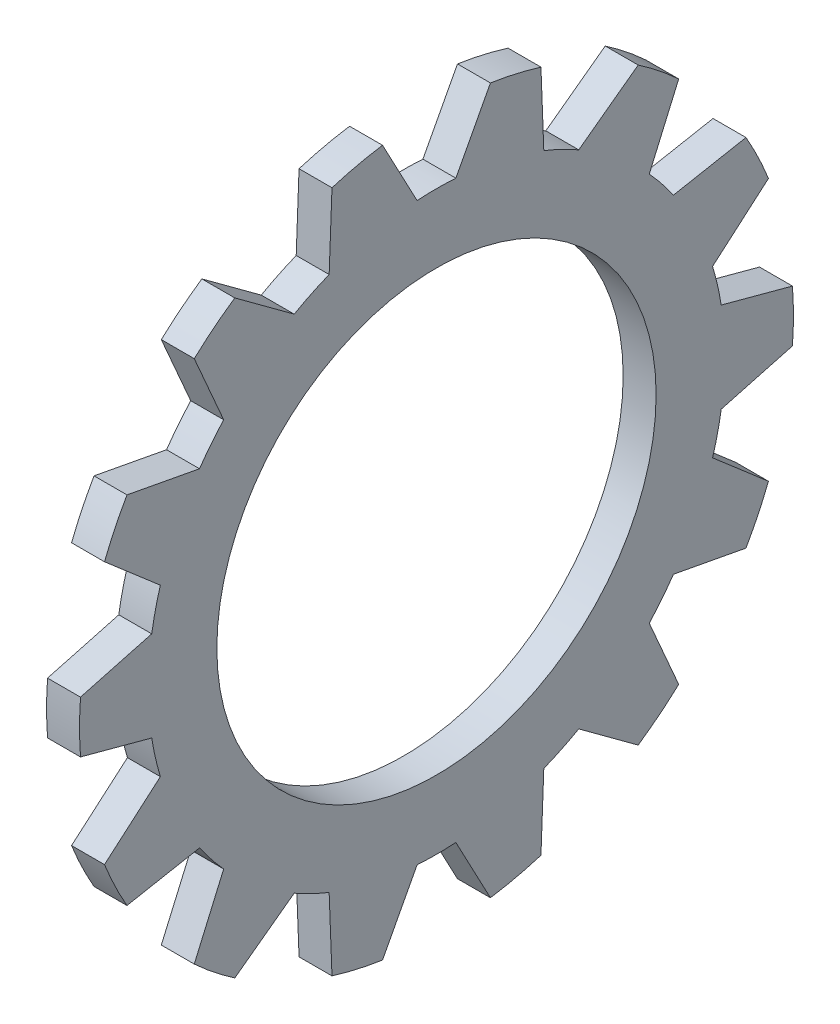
from build123d import *

# Parameters (mm, degrees)
SECSKE_W      = 1.2
SECSKE_H      = 5
EXTCUT_DEPTH  = 19.423897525
EXTCUTS_COUNT = 14
EXTCUTS_ANGLE = 334.285714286


with BuildPart() as part:
    # SecSke → Body (revolve)
    with BuildSketch(Plane.XY, mode=Mode.PRIVATE) as body_sk:
        with Locations((-0.6, 10.5)):
            Rectangle(SECSKE_W, SECSKE_H)
    revolve(body_sk.sketch.rotate(Axis((-34.925, 0, 0), (1, 0, 0)), 90), axis=Axis((-34.925, 0, 0), (1, 0, 0)))

    # ExtCutSke → ExtCut (cut, through all)
    with BuildSketch(Plane(origin=(0, 0, 0), x_dir=(0, 0, -1), z_dir=(1, 0, 0))):
        with BuildLine():
            Line((-2.286459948, 13.457139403), (-0.706324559, 10.476216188))
            ThreePointArc((-0.706324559, 10.476216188), (0, 10.5), (0.706324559, 10.476216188))
            Line((0.706324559, 10.476216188), (2.286459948, 13.457139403))
            ThreePointArc((2.286459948, 13.457139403), (0, 13.65), (-2.286459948, 13.457139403))
        make_face()
    extcut = extrude(amount=-EXTCUT_DEPTH, mode=Mode.SUBTRACT)

    # ExtCuts: ExtCut ×14 about axis
    extcuts_axis = Axis((-34.925, 0, 0), (1, 0, 0))
    for i in range(1, EXTCUTS_COUNT):
        add(extcut.rotate(extcuts_axis, i * EXTCUTS_ANGLE / (EXTCUTS_COUNT - 1)), mode=Mode.SUBTRACT)


solid = part.part
